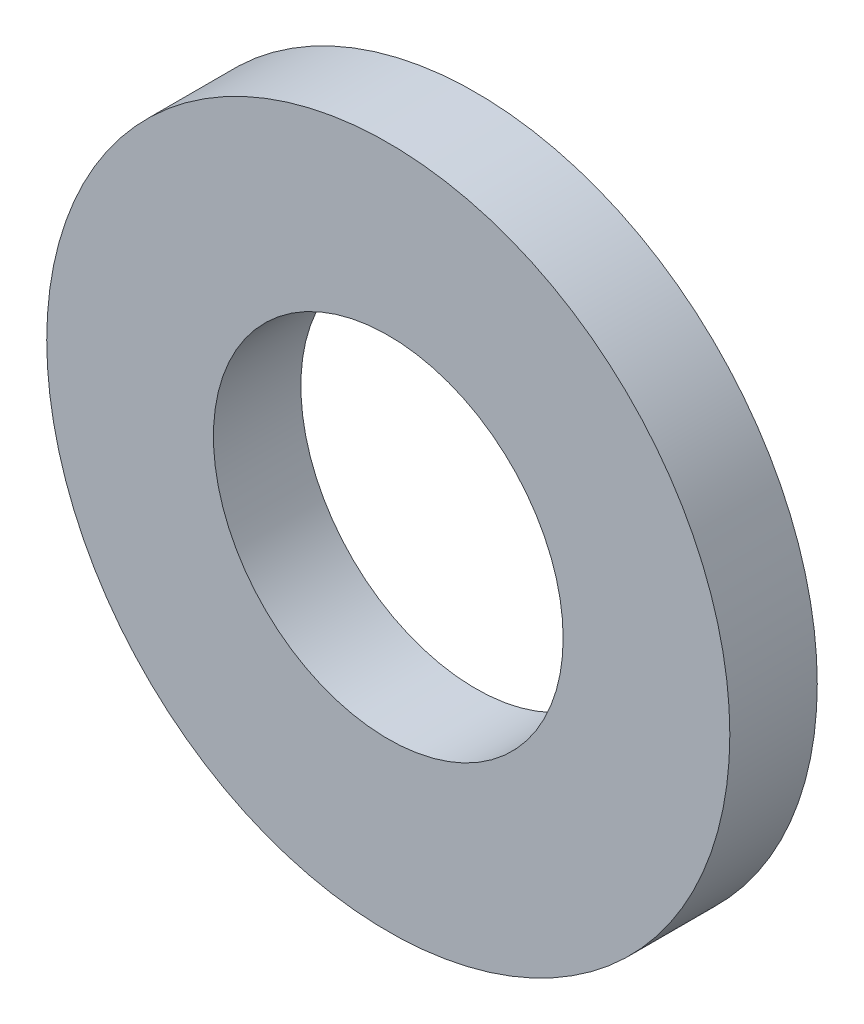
from build123d import *

# Parameters (mm, degrees)
SKETCH1_R          = 6.25
SKETCH1_R_2        = 3.2
BASE_EXTRUDE_DEPTH = 1.6


with BuildPart() as part:
    # Sketch1 → Base-Extrude (new body)
    with BuildSketch(Plane.XY):
        Circle(SKETCH1_R)
        Circle(SKETCH1_R_2, mode=Mode.SUBTRACT)
    extrude(amount=BASE_EXTRUDE_DEPTH)


solid = part.part
